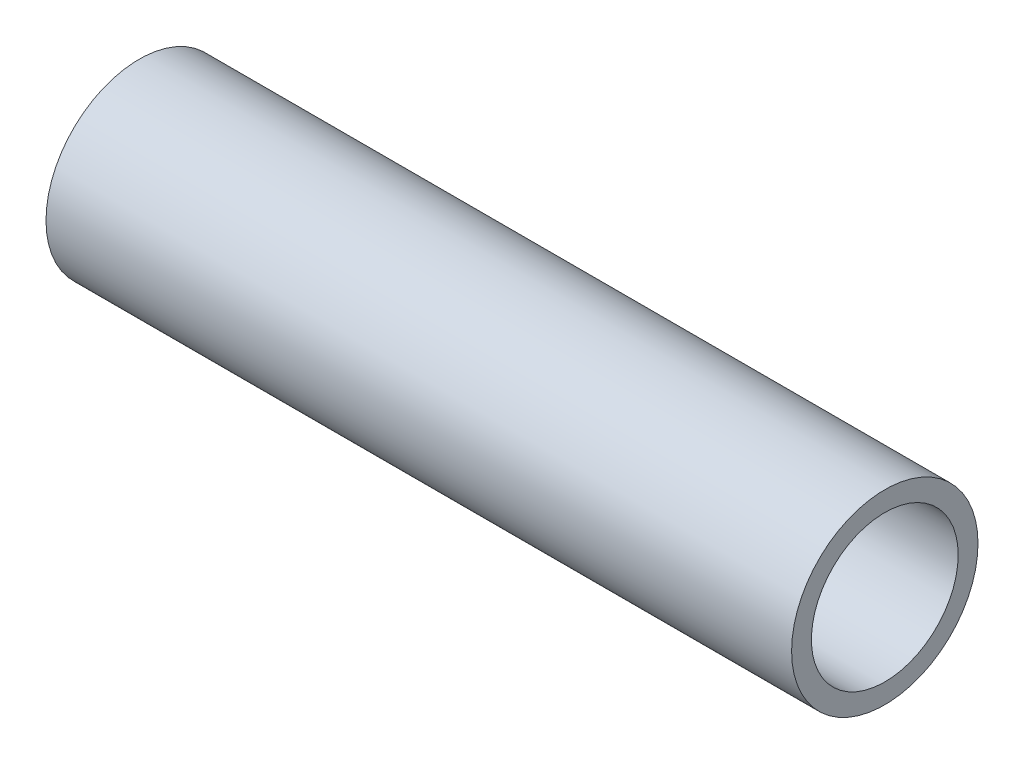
from build123d import *

# Parameters (mm, degrees)
SKETCH1_R      = 6.35
SKETCH1_R_2    = 5
EXTRUDE1_DEPTH = 25.4


with BuildPart() as part:
    # Sketch1 → Extrude1 (new, symmetric)
    with BuildSketch(Plane(origin=(0, 0, 0), x_dir=(0, 0, -1), z_dir=(1, 0, 0))):
        Circle(SKETCH1_R)
        Circle(SKETCH1_R_2, mode=Mode.SUBTRACT)
    extrude(amount=EXTRUDE1_DEPTH, both=True)


solid = part.part
